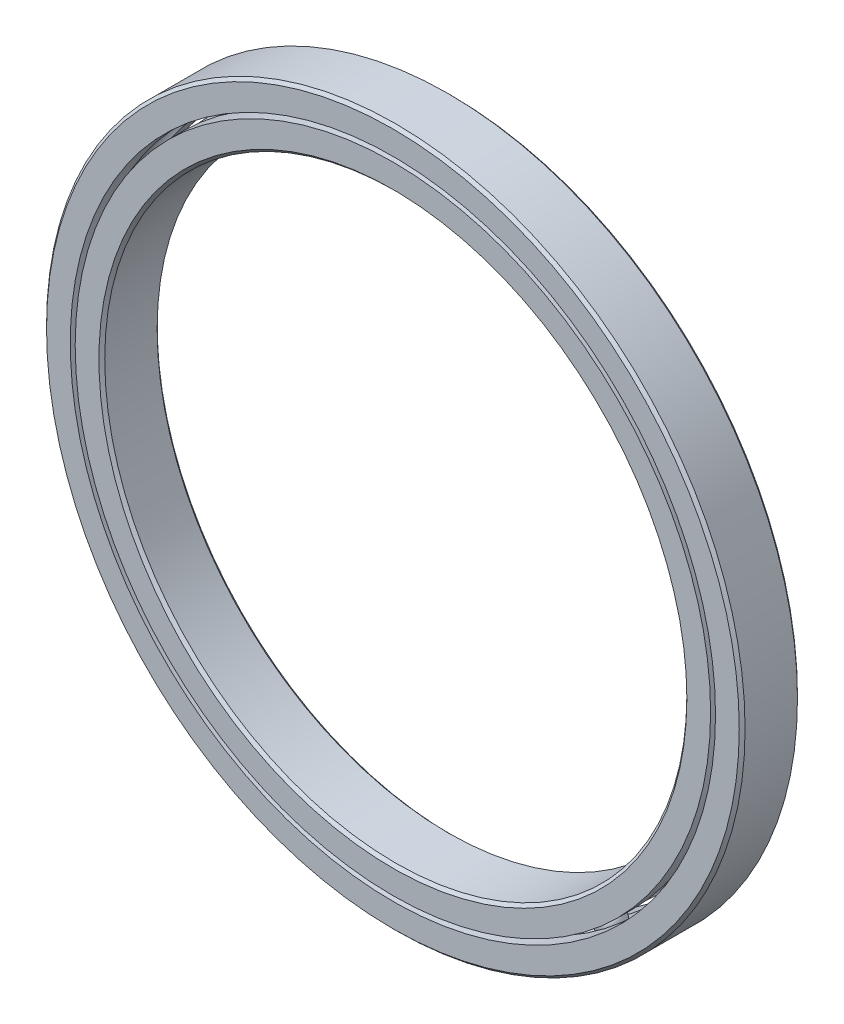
ISO-10303-21;
HEADER;
FILE_DESCRIPTION(('STEP AP214'),'2;1');
FILE_NAME('part.step','',(''),(''),'','','');
FILE_SCHEMA(('AUTOMOTIVE_DESIGN { 1 0 10303 214 1 1 1 1 }'));
ENDSEC;
DATA;
#1=APPLICATION_CONTEXT('core data for automotive mechanical design processes');
#2=APPLICATION_PROTOCOL_DEFINITION('international standard','automotive_design',2000,#1);
#3=PRODUCT_CONTEXT('',#1,'mechanical');
#4=PRODUCT('Part','Part','',(#3));
#5=PRODUCT_RELATED_PRODUCT_CATEGORY('part','',(#4));
#6=PRODUCT_DEFINITION_FORMATION('','',#4);
#7=PRODUCT_DEFINITION_CONTEXT('part definition',#1,'design');
#8=PRODUCT_DEFINITION('design','',#6,#7);
#9=PRODUCT_DEFINITION_SHAPE('','',#8);
#10=(LENGTH_UNIT() NAMED_UNIT(*) SI_UNIT(.MILLI.,.METRE.));
#11=(NAMED_UNIT(*) PLANE_ANGLE_UNIT() SI_UNIT($,.RADIAN.));
#12=(NAMED_UNIT(*) SI_UNIT($,.STERADIAN.) SOLID_ANGLE_UNIT());
#13=UNCERTAINTY_MEASURE_WITH_UNIT(LENGTH_MEASURE(1.E-05),#10,'distance_accuracy_value','');
#14=(GEOMETRIC_REPRESENTATION_CONTEXT(3) GLOBAL_UNCERTAINTY_ASSIGNED_CONTEXT((#13)) GLOBAL_UNIT_ASSIGNED_CONTEXT((#10,
#11,#12)) REPRESENTATION_CONTEXT('',''));
#15=CARTESIAN_POINT('',(0.,0.,0.));
#16=DIRECTION('',(0.,0.,1.));
#17=DIRECTION('',(1.,0.,0.));
#18=AXIS2_PLACEMENT_3D('',#15,#16,#17);
#19=CARTESIAN_POINT('',(-20.5283999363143,28.2549185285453,0.));
#20=DIRECTION('',(0.,0.,1.));
#21=DIRECTION('',(-0.587785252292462,0.809016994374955,0.));
#22=AXIS2_PLACEMENT_3D('',#19,#20,#21);
#23=SPHERICAL_SURFACE('',#22,1.4364572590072);
#24=CARTESIAN_POINT('',(-20.5283999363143,28.2549185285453,1.4364572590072));
#25=VERTEX_POINT('',#24);
#26=VERTEX_LOOP('',#25);
#27=FACE_BOUND('',#26,.T.);
#28=ADVANCED_FACE('F47',(#27),#23,.T.);
#29=CLOSED_SHELL('',(#28));
#30=MANIFOLD_SOLID_BREP('B2',#29);
#31=CARTESIAN_POINT('',(-33.2156488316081,10.7924185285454,0.));
#32=DIRECTION('',(0.,0.,1.));
#33=DIRECTION('',(-0.95105651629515,0.309016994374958,0.));
#34=AXIS2_PLACEMENT_3D('',#31,#32,#33);
#35=SPHERICAL_SURFACE('',#34,1.4364572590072);
#36=CARTESIAN_POINT('',(-33.2156488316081,10.7924185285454,1.4364572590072));
#37=VERTEX_POINT('',#36);
#38=VERTEX_LOOP('',#37);
#39=FACE_BOUND('',#38,.T.);
#40=ADVANCED_FACE('F68',(#39),#35,.T.);
#41=CLOSED_SHELL('',(#40));
#42=MANIFOLD_SOLID_BREP('B6',#41);
#43=CARTESIAN_POINT('',(-33.2156488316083,-10.7924185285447,0.));
#44=DIRECTION('',(0.,0.,1.));
#45=DIRECTION('',(-0.951056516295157,-0.309016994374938,0.));
#46=AXIS2_PLACEMENT_3D('',#43,#44,#45);
#47=SPHERICAL_SURFACE('',#46,1.4364572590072);
#48=CARTESIAN_POINT('',(-33.2156488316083,-10.7924185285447,1.4364572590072));
#49=VERTEX_POINT('',#48);
#50=VERTEX_LOOP('',#49);
#51=FACE_BOUND('',#50,.T.);
#52=ADVANCED_FACE('F89',(#51),#47,.T.);
#53=CLOSED_SHELL('',(#52));
#54=MANIFOLD_SOLID_BREP('B43',#53);
#55=CARTESIAN_POINT('',(-20.5283999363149,-28.2549185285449,0.));
#56=DIRECTION('',(0.,0.,1.));
#57=DIRECTION('',(-0.58778525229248,-0.809016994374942,0.));
#58=AXIS2_PLACEMENT_3D('',#55,#56,#57);
#59=SPHERICAL_SURFACE('',#58,1.4364572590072);
#60=CARTESIAN_POINT('',(-20.5283999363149,-28.2549185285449,1.4364572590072));
#61=VERTEX_POINT('',#60);
#62=VERTEX_LOOP('',#61);
#63=FACE_BOUND('',#62,.T.);
#64=ADVANCED_FACE('F110',(#63),#59,.T.);
#65=CLOSED_SHELL('',(#64));
#66=MANIFOLD_SOLID_BREP('B64',#65);
#67=CARTESIAN_POINT('',(-2.4388011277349E-13,-34.925,0.));
#68=DIRECTION('',(0.,0.,1.));
#69=DIRECTION('',(0.,-1.,0.));
#70=AXIS2_PLACEMENT_3D('',#67,#68,#69);
#71=SPHERICAL_SURFACE('',#70,1.4364572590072);
#72=CARTESIAN_POINT('',(-2.4388011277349E-13,-34.925,1.4364572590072));
#73=VERTEX_POINT('',#72);
#74=VERTEX_LOOP('',#73);
#75=FACE_BOUND('',#74,.T.);
#76=ADVANCED_FACE('F131',(#75),#71,.T.);
#77=CLOSED_SHELL('',(#76));
#78=MANIFOLD_SOLID_BREP('B85',#77);
#79=CARTESIAN_POINT('',(20.5283999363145,-28.2549185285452,0.));
#80=DIRECTION('',(0.,0.,1.));
#81=DIRECTION('',(0.587785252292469,-0.809016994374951,0.));
#82=AXIS2_PLACEMENT_3D('',#79,#80,#81);
#83=SPHERICAL_SURFACE('',#82,1.4364572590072);
#84=CARTESIAN_POINT('',(20.5283999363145,-28.2549185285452,1.4364572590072));
#85=VERTEX_POINT('',#84);
#86=VERTEX_LOOP('',#85);
#87=FACE_BOUND('',#86,.T.);
#88=ADVANCED_FACE('F152',(#87),#83,.T.);
#89=CLOSED_SHELL('',(#88));
#90=MANIFOLD_SOLID_BREP('B106',#89);
#91=CARTESIAN_POINT('',(33.2156488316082,-10.7924185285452,0.));
#92=DIRECTION('',(0.,0.,1.));
#93=DIRECTION('',(0.951056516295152,-0.309016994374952,0.));
#94=AXIS2_PLACEMENT_3D('',#91,#92,#93);
#95=SPHERICAL_SURFACE('',#94,1.4364572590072);
#96=CARTESIAN_POINT('',(33.2156488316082,-10.7924185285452,1.4364572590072));
#97=VERTEX_POINT('',#96);
#98=VERTEX_LOOP('',#97);
#99=FACE_BOUND('',#98,.T.);
#100=ADVANCED_FACE('F173',(#99),#95,.T.);
#101=CLOSED_SHELL('',(#100));
#102=MANIFOLD_SOLID_BREP('B127',#101);
#103=CARTESIAN_POINT('',(33.2156488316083,10.7924185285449,0.));
#104=DIRECTION('',(0.,0.,1.));
#105=DIRECTION('',(0.951056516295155,0.309016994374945,0.));
#106=AXIS2_PLACEMENT_3D('',#103,#104,#105);
#107=SPHERICAL_SURFACE('',#106,1.4364572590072);
#108=CARTESIAN_POINT('',(33.2156488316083,10.7924185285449,1.4364572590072));
#109=VERTEX_POINT('',#108);
#110=VERTEX_LOOP('',#109);
#111=FACE_BOUND('',#110,.T.);
#112=ADVANCED_FACE('F194',(#111),#107,.T.);
#113=CLOSED_SHELL('',(#112));
#114=MANIFOLD_SOLID_BREP('B148',#113);
#115=CARTESIAN_POINT('',(20.5283999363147,28.254918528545,0.));
#116=DIRECTION('',(0.,0.,1.));
#117=DIRECTION('',(0.587785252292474,0.809016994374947,0.));
#118=AXIS2_PLACEMENT_3D('',#115,#116,#117);
#119=SPHERICAL_SURFACE('',#118,1.4364572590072);
#120=CARTESIAN_POINT('',(20.5283999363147,28.254918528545,1.4364572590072));
#121=VERTEX_POINT('',#120);
#122=VERTEX_LOOP('',#121);
#123=FACE_BOUND('',#122,.T.);
#124=ADVANCED_FACE('F215',(#123),#119,.T.);
#125=CLOSED_SHELL('',(#124));
#126=MANIFOLD_SOLID_BREP('B169',#125);
#127=CARTESIAN_POINT('',(0.,34.925,0.));
#128=DIRECTION('',(0.,0.,1.));
#129=DIRECTION('',(0.,1.,0.));
#130=AXIS2_PLACEMENT_3D('',#127,#128,#129);
#131=SPHERICAL_SURFACE('',#130,1.4364572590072);
#132=CARTESIAN_POINT('',(0.,34.925,1.4364572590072));
#133=VERTEX_POINT('',#132);
#134=VERTEX_LOOP('',#133);
#135=FACE_BOUND('',#134,.T.);
#136=ADVANCED_FACE('F238',(#135),#131,.T.);
#137=CLOSED_SHELL('',(#136));
#138=MANIFOLD_SOLID_BREP('B190',#137);
#139=CARTESIAN_POINT('',(0.,34.6563461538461,3.17500000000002));
#140=DIRECTION('',(0.,0.,-1.));
#141=DIRECTION('',(-1.,0.,0.));
#142=AXIS2_PLACEMENT_3D('',#139,#140,#141);
#143=PLANE('',#142);
#144=CARTESIAN_POINT('',(0.,0.,3.17500000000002));
#145=DIRECTION('',(0.,0.,1.));
#146=DIRECTION('',(1.,0.,0.));
#147=AXIS2_PLACEMENT_3D('',#144,#145,#146);
#148=CIRCLE('',#147,32.0675);
#149=CARTESIAN_POINT('',(32.0675,0.,3.17500000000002));
#150=VERTEX_POINT('',#149);
#151=EDGE_CURVE('E295',#150,#150,#148,.T.);
#152=ORIENTED_EDGE('',*,*,#151,.F.);
#153=EDGE_LOOP('',(#152));
#154=FACE_BOUND('',#153,.T.);
#155=CARTESIAN_POINT('',(0.,0.,3.17500000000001));
#156=DIRECTION('',(0.,0.,1.));
#157=DIRECTION('',(1.,0.,0.));
#158=AXIS2_PLACEMENT_3D('',#155,#156,#157);
#159=CIRCLE('',#158,34.6563461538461);
#160=CARTESIAN_POINT('',(34.6563461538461,0.,3.17500000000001));
#161=VERTEX_POINT('',#160);
#162=EDGE_CURVE('E237',#161,#161,#159,.T.);
#163=ORIENTED_EDGE('',*,*,#162,.T.);
#164=EDGE_LOOP('',(#163));
#165=FACE_BOUND('',#164,.T.);
#166=ADVANCED_FACE('F258',(#154,#165),#143,.F.);
#167=CARTESIAN_POINT('',(0.,0.,3.175));
#168=DIRECTION('',(0.,0.,1.));
#169=DIRECTION('',(1.,0.,0.));
#170=AXIS2_PLACEMENT_3D('',#167,#168,#169);
#171=CYLINDRICAL_SURFACE('',#170,34.6563461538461);
#172=ORIENTED_EDGE('',*,*,#162,.F.);
#173=EDGE_LOOP('',(#172));
#174=FACE_BOUND('',#173,.T.);
#175=CARTESIAN_POINT('',(0.,0.,1.4111111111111));
#176=DIRECTION('',(0.,0.,1.));
#177=DIRECTION('',(1.,0.,0.));
#178=AXIS2_PLACEMENT_3D('',#175,#176,#177);
#179=CIRCLE('',#178,34.6563461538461);
#180=CARTESIAN_POINT('',(34.6563461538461,0.,1.4111111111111));
#181=VERTEX_POINT('',#180);
#182=EDGE_CURVE('E265',#181,#181,#179,.T.);
#183=ORIENTED_EDGE('',*,*,#182,.T.);
#184=EDGE_LOOP('',(#183));
#185=FACE_BOUND('',#184,.T.);
#186=ADVANCED_FACE('F304',(#174,#185),#171,.T.);
#187=CARTESIAN_POINT('',(0.,0.,0.));
#188=DIRECTION('',(0.,0.,1.));
#189=DIRECTION('',(1.,0.,0.));
#190=AXIS2_PLACEMENT_3D('',#187,#188,#189);
#191=TOROIDAL_SURFACE('',#190,34.9249999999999,1.43645725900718);
#192=ORIENTED_EDGE('',*,*,#182,.F.);
#193=EDGE_LOOP('',(#192));
#194=FACE_BOUND('',#193,.T.);
#195=CARTESIAN_POINT('',(0.,0.,-1.41111111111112));
#196=DIRECTION('',(0.,0.,1.));
#197=DIRECTION('',(1.,0.,0.));
#198=AXIS2_PLACEMENT_3D('',#195,#196,#197);
#199=CIRCLE('',#198,34.6563461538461);
#200=CARTESIAN_POINT('',(34.6563461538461,0.,-1.41111111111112));
#201=VERTEX_POINT('',#200);
#202=EDGE_CURVE('E271',#201,#201,#199,.T.);
#203=ORIENTED_EDGE('',*,*,#202,.T.);
#204=EDGE_LOOP('',(#203));
#205=FACE_BOUND('',#204,.T.);
#206=ADVANCED_FACE('F308',(#194,#205),#191,.F.);
#207=CARTESIAN_POINT('',(0.,0.,3.175));
#208=DIRECTION('',(0.,0.,1.));
#209=DIRECTION('',(1.,0.,0.));
#210=AXIS2_PLACEMENT_3D('',#207,#208,#209);
#211=CYLINDRICAL_SURFACE('',#210,34.6563461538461);
#212=ORIENTED_EDGE('',*,*,#202,.F.);
#213=EDGE_LOOP('',(#212));
#214=FACE_BOUND('',#213,.T.);
#215=CARTESIAN_POINT('',(0.,0.,-3.17500000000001));
#216=DIRECTION('',(0.,0.,1.));
#217=DIRECTION('',(1.,0.,0.));
#218=AXIS2_PLACEMENT_3D('',#215,#216,#217);
#219=CIRCLE('',#218,34.6563461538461);
#220=CARTESIAN_POINT('',(34.6563461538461,0.,-3.17500000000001));
#221=VERTEX_POINT('',#220);
#222=EDGE_CURVE('E277',#221,#221,#219,.T.);
#223=ORIENTED_EDGE('',*,*,#222,.T.);
#224=EDGE_LOOP('',(#223));
#225=FACE_BOUND('',#224,.T.);
#226=ADVANCED_FACE('F313',(#214,#225),#211,.T.);
#227=CARTESIAN_POINT('',(0.,32.0675,-3.17500000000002));
#228=DIRECTION('',(0.,0.,1.));
#229=DIRECTION('',(1.,0.,0.));
#230=AXIS2_PLACEMENT_3D('',#227,#228,#229);
#231=PLANE('',#230);
#232=ORIENTED_EDGE('',*,*,#222,.F.);
#233=EDGE_LOOP('',(#232));
#234=FACE_BOUND('',#233,.T.);
#235=CARTESIAN_POINT('',(0.,0.,-3.17500000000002));
#236=DIRECTION('',(0.,0.,1.));
#237=DIRECTION('',(1.,0.,0.));
#238=AXIS2_PLACEMENT_3D('',#235,#236,#237);
#239=CIRCLE('',#238,32.0675);
#240=CARTESIAN_POINT('',(32.0675,0.,-3.17500000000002));
#241=VERTEX_POINT('',#240);
#242=EDGE_CURVE('E283',#241,#241,#239,.T.);
#243=ORIENTED_EDGE('',*,*,#242,.T.);
#244=EDGE_LOOP('',(#243));
#245=FACE_BOUND('',#244,.T.);
#246=ADVANCED_FACE('F319',(#234,#245),#231,.F.);
#247=CARTESIAN_POINT('',(0.,0.,-2.85750000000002));
#248=DIRECTION('',(0.,0.,-1.));
#249=DIRECTION('',(-1.,0.,0.));
#250=AXIS2_PLACEMENT_3D('',#247,#248,#249);
#251=CONICAL_SURFACE('',#250,31.75,0.785398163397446);
#252=ORIENTED_EDGE('',*,*,#242,.F.);
#253=EDGE_LOOP('',(#252));
#254=FACE_BOUND('',#253,.T.);
#255=CARTESIAN_POINT('',(0.,0.,-2.85750000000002));
#256=DIRECTION('',(0.,0.,1.));
#257=DIRECTION('',(1.,0.,0.));
#258=AXIS2_PLACEMENT_3D('',#255,#256,#257);
#259=CIRCLE('',#258,31.75);
#260=CARTESIAN_POINT('',(31.75,0.,-2.85750000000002));
#261=VERTEX_POINT('',#260);
#262=EDGE_CURVE('E287',#261,#261,#259,.T.);
#263=ORIENTED_EDGE('',*,*,#262,.T.);
#264=EDGE_LOOP('',(#263));
#265=FACE_BOUND('',#264,.T.);
#266=ADVANCED_FACE('F323',(#254,#265),#251,.F.);
#267=CARTESIAN_POINT('',(0.,0.,3.175));
#268=DIRECTION('',(0.,0.,1.));
#269=DIRECTION('',(1.,0.,0.));
#270=AXIS2_PLACEMENT_3D('',#267,#268,#269);
#271=CYLINDRICAL_SURFACE('',#270,31.75);
#272=ORIENTED_EDGE('',*,*,#262,.F.);
#273=EDGE_LOOP('',(#272));
#274=FACE_BOUND('',#273,.T.);
#275=CARTESIAN_POINT('',(0.,0.,2.85750000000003));
#276=DIRECTION('',(0.,0.,1.));
#277=DIRECTION('',(1.,0.,0.));
#278=AXIS2_PLACEMENT_3D('',#275,#276,#277);
#279=CIRCLE('',#278,31.75);
#280=CARTESIAN_POINT('',(31.75,0.,2.85750000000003));
#281=VERTEX_POINT('',#280);
#282=EDGE_CURVE('E291',#281,#281,#279,.T.);
#283=ORIENTED_EDGE('',*,*,#282,.T.);
#284=EDGE_LOOP('',(#283));
#285=FACE_BOUND('',#284,.T.);
#286=ADVANCED_FACE('F327',(#274,#285),#271,.F.);
#287=CARTESIAN_POINT('',(0.,0.,3.17500000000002));
#288=DIRECTION('',(0.,0.,1.));
#289=DIRECTION('',(1.,0.,0.));
#290=AXIS2_PLACEMENT_3D('',#287,#288,#289);
#291=CONICAL_SURFACE('',#290,32.0675,0.785398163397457);
#292=ORIENTED_EDGE('',*,*,#282,.F.);
#293=EDGE_LOOP('',(#292));
#294=FACE_BOUND('',#293,.T.);
#295=ORIENTED_EDGE('',*,*,#151,.T.);
#296=EDGE_LOOP('',(#295));
#297=FACE_BOUND('',#296,.T.);
#298=ADVANCED_FACE('F301',(#294,#297),#291,.F.);
#299=CLOSED_SHELL('',(#166,#186,#206,#226,#246,#266,#286,#298));
#300=MANIFOLD_SOLID_BREP('B211',#299);
#301=CARTESIAN_POINT('',(0.,0.,2.8575));
#302=DIRECTION('',(0.,0.,-1.));
#303=DIRECTION('',(-1.,0.,0.));
#304=AXIS2_PLACEMENT_3D('',#301,#302,#303);
#305=CONICAL_SURFACE('',#304,38.1,0.785398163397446);
#306=CARTESIAN_POINT('',(0.,0.,3.175));
#307=DIRECTION('',(0.,0.,1.));
#308=DIRECTION('',(1.,0.,0.));
#309=AXIS2_PLACEMENT_3D('',#306,#307,#308);
#310=CIRCLE('',#309,37.7825);
#311=CARTESIAN_POINT('',(37.7825,0.,3.175));
#312=VERTEX_POINT('',#311);
#313=EDGE_CURVE('E440',#312,#312,#310,.T.);
#314=ORIENTED_EDGE('',*,*,#313,.F.);
#315=EDGE_LOOP('',(#314));
#316=FACE_BOUND('',#315,.T.);
#317=CARTESIAN_POINT('',(0.,0.,2.8575));
#318=DIRECTION('',(0.,0.,1.));
#319=DIRECTION('',(1.,0.,0.));
#320=AXIS2_PLACEMENT_3D('',#317,#318,#319);
#321=CIRCLE('',#320,38.1);
#322=CARTESIAN_POINT('',(38.1,0.,2.8575));
#323=VERTEX_POINT('',#322);
#324=EDGE_CURVE('E257',#323,#323,#321,.T.);
#325=ORIENTED_EDGE('',*,*,#324,.T.);
#326=EDGE_LOOP('',(#325));
#327=FACE_BOUND('',#326,.T.);
#328=ADVANCED_FACE('F403',(#316,#327),#305,.T.);
#329=CARTESIAN_POINT('',(0.,0.,3.175));
#330=DIRECTION('',(0.,0.,1.));
#331=DIRECTION('',(1.,0.,0.));
#332=AXIS2_PLACEMENT_3D('',#329,#330,#331);
#333=CYLINDRICAL_SURFACE('',#332,38.1);
#334=ORIENTED_EDGE('',*,*,#324,.F.);
#335=EDGE_LOOP('',(#334));
#336=FACE_BOUND('',#335,.T.);
#337=CARTESIAN_POINT('',(0.,0.,-2.85750000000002));
#338=DIRECTION('',(0.,0.,1.));
#339=DIRECTION('',(1.,0.,0.));
#340=AXIS2_PLACEMENT_3D('',#337,#338,#339);
#341=CIRCLE('',#340,38.1);
#342=CARTESIAN_POINT('',(38.1,0.,-2.85750000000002));
#343=VERTEX_POINT('',#342);
#344=EDGE_CURVE('E410',#343,#343,#341,.T.);
#345=ORIENTED_EDGE('',*,*,#344,.T.);
#346=EDGE_LOOP('',(#345));
#347=FACE_BOUND('',#346,.T.);
#348=ADVANCED_FACE('F449',(#336,#347),#333,.T.);
#349=CARTESIAN_POINT('',(0.,0.,-3.17500000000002));
#350=DIRECTION('',(0.,0.,1.));
#351=DIRECTION('',(1.,0.,0.));
#352=AXIS2_PLACEMENT_3D('',#349,#350,#351);
#353=CONICAL_SURFACE('',#352,37.7825,0.785398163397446);
#354=ORIENTED_EDGE('',*,*,#344,.F.);
#355=EDGE_LOOP('',(#354));
#356=FACE_BOUND('',#355,.T.);
#357=CARTESIAN_POINT('',(0.,0.,-3.17500000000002));
#358=DIRECTION('',(0.,0.,1.));
#359=DIRECTION('',(1.,0.,0.));
#360=AXIS2_PLACEMENT_3D('',#357,#358,#359);
#361=CIRCLE('',#360,37.7825);
#362=CARTESIAN_POINT('',(37.7825,0.,-3.17500000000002));
#363=VERTEX_POINT('',#362);
#364=EDGE_CURVE('E418',#363,#363,#361,.T.);
#365=ORIENTED_EDGE('',*,*,#364,.T.);
#366=EDGE_LOOP('',(#365));
#367=FACE_BOUND('',#366,.T.);
#368=ADVANCED_FACE('F453',(#356,#367),#353,.T.);
#369=CARTESIAN_POINT('',(0.,37.7825,-3.17500000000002));
#370=DIRECTION('',(0.,0.,1.));
#371=DIRECTION('',(1.,0.,0.));
#372=AXIS2_PLACEMENT_3D('',#369,#370,#371);
#373=PLANE('',#372);
#374=ORIENTED_EDGE('',*,*,#364,.F.);
#375=EDGE_LOOP('',(#374));
#376=FACE_BOUND('',#375,.T.);
#377=CARTESIAN_POINT('',(0.,0.,-3.17500000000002));
#378=DIRECTION('',(0.,0.,1.));
#379=DIRECTION('',(1.,0.,0.));
#380=AXIS2_PLACEMENT_3D('',#377,#378,#379);
#381=CIRCLE('',#380,35.1936538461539);
#382=CARTESIAN_POINT('',(35.1936538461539,0.,-3.17500000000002));
#383=VERTEX_POINT('',#382);
#384=EDGE_CURVE('E425',#383,#383,#381,.T.);
#385=ORIENTED_EDGE('',*,*,#384,.T.);
#386=EDGE_LOOP('',(#385));
#387=FACE_BOUND('',#386,.T.);
#388=ADVANCED_FACE('F458',(#376,#387),#373,.F.);
#389=CARTESIAN_POINT('',(0.,0.,3.175));
#390=DIRECTION('',(0.,0.,1.));
#391=DIRECTION('',(1.,0.,0.));
#392=AXIS2_PLACEMENT_3D('',#389,#390,#391);
#393=CYLINDRICAL_SURFACE('',#392,35.1936538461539);
#394=ORIENTED_EDGE('',*,*,#384,.F.);
#395=EDGE_LOOP('',(#394));
#396=FACE_BOUND('',#395,.T.);
#397=CARTESIAN_POINT('',(0.,0.,-1.41111111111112));
#398=DIRECTION('',(0.,0.,1.));
#399=DIRECTION('',(1.,0.,0.));
#400=AXIS2_PLACEMENT_3D('',#397,#398,#399);
#401=CIRCLE('',#400,35.1936538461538);
#402=CARTESIAN_POINT('',(35.1936538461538,0.,-1.41111111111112));
#403=VERTEX_POINT('',#402);
#404=EDGE_CURVE('E431',#403,#403,#401,.T.);
#405=ORIENTED_EDGE('',*,*,#404,.T.);
#406=EDGE_LOOP('',(#405));
#407=FACE_BOUND('',#406,.T.);
#408=ADVANCED_FACE('F464',(#396,#407),#393,.F.);
#409=CARTESIAN_POINT('',(0.,0.,0.));
#410=DIRECTION('',(0.,0.,1.));
#411=DIRECTION('',(1.,0.,0.));
#412=AXIS2_PLACEMENT_3D('',#409,#410,#411);
#413=TOROIDAL_SURFACE('',#412,34.925,1.4364572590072);
#414=ORIENTED_EDGE('',*,*,#404,.F.);
#415=EDGE_LOOP('',(#414));
#416=FACE_BOUND('',#415,.T.);
#417=CARTESIAN_POINT('',(0.,0.,1.4111111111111));
#418=DIRECTION('',(0.,0.,1.));
#419=DIRECTION('',(1.,0.,0.));
#420=AXIS2_PLACEMENT_3D('',#417,#418,#419);
#421=CIRCLE('',#420,35.1936538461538);
#422=CARTESIAN_POINT('',(35.1936538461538,0.,1.4111111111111));
#423=VERTEX_POINT('',#422);
#424=EDGE_CURVE('E434',#423,#423,#421,.T.);
#425=ORIENTED_EDGE('',*,*,#424,.T.);
#426=EDGE_LOOP('',(#425));
#427=FACE_BOUND('',#426,.T.);
#428=ADVANCED_FACE('F468',(#416,#427),#413,.F.);
#429=CARTESIAN_POINT('',(0.,0.,3.175));
#430=DIRECTION('',(0.,0.,1.));
#431=DIRECTION('',(1.,0.,0.));
#432=AXIS2_PLACEMENT_3D('',#429,#430,#431);
#433=CYLINDRICAL_SURFACE('',#432,35.1936538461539);
#434=ORIENTED_EDGE('',*,*,#424,.F.);
#435=EDGE_LOOP('',(#434));
#436=FACE_BOUND('',#435,.T.);
#437=CARTESIAN_POINT('',(0.,0.,3.175));
#438=DIRECTION('',(0.,0.,1.));
#439=DIRECTION('',(1.,0.,0.));
#440=AXIS2_PLACEMENT_3D('',#437,#438,#439);
#441=CIRCLE('',#440,35.1936538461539);
#442=CARTESIAN_POINT('',(35.1936538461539,0.,3.175));
#443=VERTEX_POINT('',#442);
#444=EDGE_CURVE('E437',#443,#443,#441,.T.);
#445=ORIENTED_EDGE('',*,*,#444,.T.);
#446=EDGE_LOOP('',(#445));
#447=FACE_BOUND('',#446,.T.);
#448=ADVANCED_FACE('F472',(#436,#447),#433,.F.);
#449=CARTESIAN_POINT('',(0.,37.7825,3.175));
#450=DIRECTION('',(0.,0.,-1.));
#451=DIRECTION('',(-1.,0.,0.));
#452=AXIS2_PLACEMENT_3D('',#449,#450,#451);
#453=PLANE('',#452);
#454=ORIENTED_EDGE('',*,*,#444,.F.);
#455=EDGE_LOOP('',(#454));
#456=FACE_BOUND('',#455,.T.);
#457=ORIENTED_EDGE('',*,*,#313,.T.);
#458=EDGE_LOOP('',(#457));
#459=FACE_BOUND('',#458,.T.);
#460=ADVANCED_FACE('F446',(#456,#459),#453,.F.);
#461=CLOSED_SHELL('',(#328,#348,#368,#388,#408,#428,#448,#460));
#462=MANIFOLD_SOLID_BREP('B232',#461);
#463=ADVANCED_BREP_SHAPE_REPRESENTATION('',(#18,#30,#42,#54,#66,#78,#90,#102,#114,#126,#138,
#300,#462),#14);
#464=SHAPE_DEFINITION_REPRESENTATION(#9,#463);
ENDSEC;
END-ISO-10303-21;
